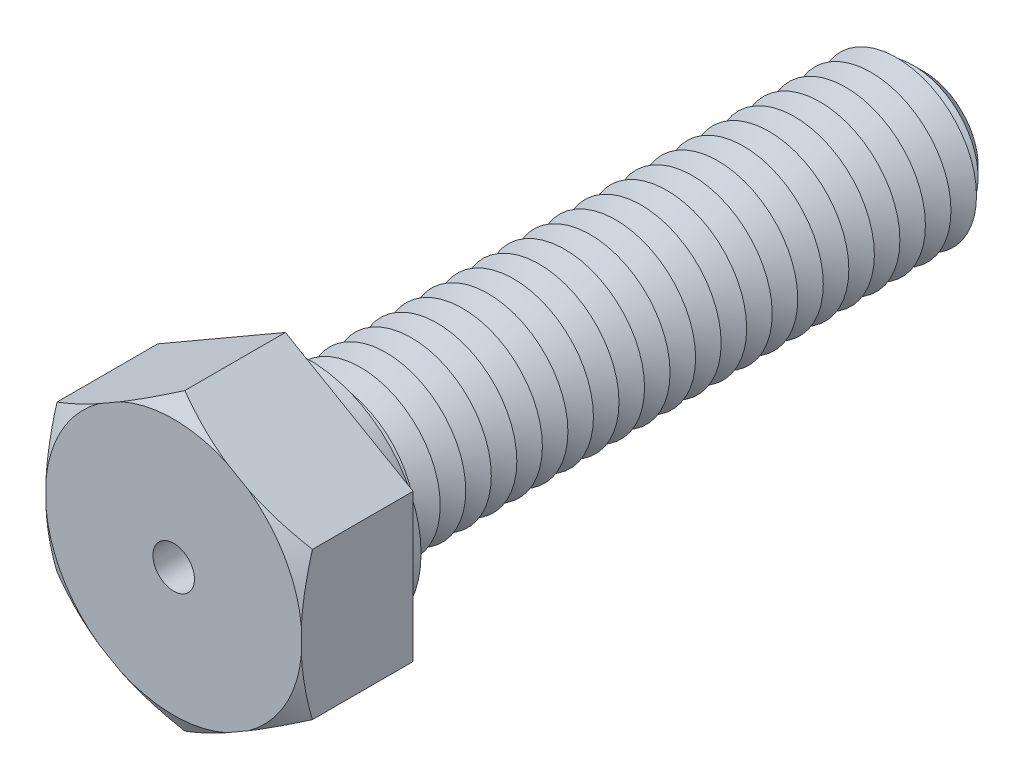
from build123d import *

# Parameters (mm, degrees)
BOSS_EXTRUDE1_DEPTH = 3.5
SKETCH3_R           = 2.5
BOSS_EXTRUDE2_DEPTH = 20
SKETCH4_R           = 3.5
BOSS_EXTRUDE3_DEPTH = 0.75
CHAMFER1_SIZE       = 0.8
LPATTERN1_COUNT     = 24
LPATTERN1_PITCH     = 0.8
SKETCH8_R           = 0.65
CUT_EXTRUDE1_DEPTH  = 23.5


with BuildPart() as part:
    # Sketch2 → Boss-Extrude1 (new body)
    with BuildSketch(Plane.XY):
        Polygon((0, 4.618802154), (-4, 2.309401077), (-4, -2.309401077), (0, -4.618802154), (4, -2.309401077), (4, 2.309401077), align=None)
    extrude(amount=BOSS_EXTRUDE1_DEPTH)

    # Sketch3 → Boss-Extrude2 (add)
    with BuildSketch(Plane(origin=(0, 0, 0), x_dir=(-1, 0, 0), z_dir=(0, 0, -1))):
        Circle(SKETCH3_R)
    extrude(amount=BOSS_EXTRUDE2_DEPTH)

    # Sketch4 → Boss-Extrude3 (add)
    with BuildSketch(Plane(origin=(0, 0, 0), x_dir=(-1, 0, 0), z_dir=(0, 0, -1))):
        with Locations(Location((0, 0, 0), (0, 0, 180))):
            Circle(SKETCH4_R)
    extrude(amount=BOSS_EXTRUDE3_DEPTH)

    # Chamfer1
    chamfer1_edges = [part.edges().sort_by_distance(p)[0] for p in [
        (2.5, 0, -20),
    ]]
    chamfer(chamfer1_edges, length=CHAMFER1_SIZE)

    # Sketch6 → Cut-Revolve1 (revolve, cut)
    with BuildSketch(Plane(origin=(0, 0, 0), x_dir=(0, 0, -1), z_dir=(1, 0, 0)), mode=Mode.PRIVATE) as cut_revolve1_sk:
        Polygon((0.75, 2.5), (1.15, 1.807179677), (1.55, 2.5), align=None)
    cut_revolve1 = revolve(cut_revolve1_sk.sketch.rotate(Axis((0, 0, 3.211670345), (0, 0, -1)), 90), axis=Axis((0, 0, 3.211670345), (0, 0, -1)), mode=Mode.SUBTRACT)

    # LPattern1: Cut-Revolve1 ×24
    with Locations(*[(0, 0, -i * LPATTERN1_PITCH) for i in range(1, LPATTERN1_COUNT)]):
        add(cut_revolve1, mode=Mode.SUBTRACT)

    # Sketch7 → Cut-Revolve2 (revolve, cut)
    with BuildSketch(Plane(origin=(0, 0, 0), x_dir=(0, 0, -1), z_dir=(1, 0, 0)), mode=Mode.PRIVATE) as cut_revolve2_sk:
        Polygon((-3.5, 4.618802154), (-3.5, 4.018802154), (-3.153589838, 4.618802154), align=None)
    revolve(cut_revolve2_sk.sketch.rotate(Axis((0, 0, 3.211670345), (0, 0, -1)), 270), axis=Axis((0, 0, 3.211670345), (0, 0, -1)), mode=Mode.SUBTRACT)

    # Sketch8 → Cut-Extrude1 (cut)
    with BuildSketch(Plane.XY.offset(3.5)):
        Circle(SKETCH8_R)
    extrude(amount=-CUT_EXTRUDE1_DEPTH, mode=Mode.SUBTRACT)


solid = part.part
